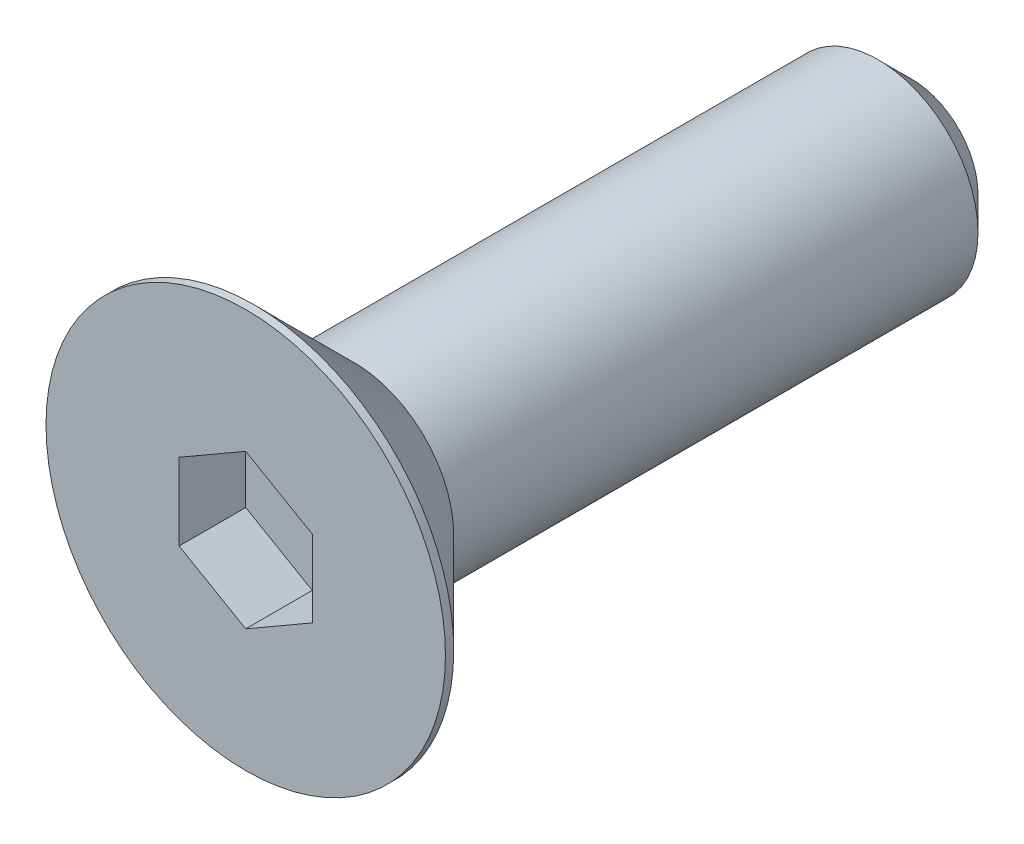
ISO-10303-21;
HEADER;
FILE_DESCRIPTION(('STEP AP214'),'2;1');
FILE_NAME('part.step','',(''),(''),'','','');
FILE_SCHEMA(('AUTOMOTIVE_DESIGN { 1 0 10303 214 1 1 1 1 }'));
ENDSEC;
DATA;
#1=APPLICATION_CONTEXT('core data for automotive mechanical design processes');
#2=APPLICATION_PROTOCOL_DEFINITION('international standard','automotive_design',2000,#1);
#3=PRODUCT_CONTEXT('',#1,'mechanical');
#4=PRODUCT('Part','Part','',(#3));
#5=PRODUCT_RELATED_PRODUCT_CATEGORY('part','',(#4));
#6=PRODUCT_DEFINITION_FORMATION('','',#4);
#7=PRODUCT_DEFINITION_CONTEXT('part definition',#1,'design');
#8=PRODUCT_DEFINITION('design','',#6,#7);
#9=PRODUCT_DEFINITION_SHAPE('','',#8);
#10=(LENGTH_UNIT() NAMED_UNIT(*) SI_UNIT(.MILLI.,.METRE.));
#11=(NAMED_UNIT(*) PLANE_ANGLE_UNIT() SI_UNIT($,.RADIAN.));
#12=(NAMED_UNIT(*) SI_UNIT($,.STERADIAN.) SOLID_ANGLE_UNIT());
#13=UNCERTAINTY_MEASURE_WITH_UNIT(LENGTH_MEASURE(1.E-05),#10,'distance_accuracy_value','');
#14=(GEOMETRIC_REPRESENTATION_CONTEXT(3) GLOBAL_UNCERTAINTY_ASSIGNED_CONTEXT((#13)) GLOBAL_UNIT_ASSIGNED_CONTEXT((#10,
#11,#12)) REPRESENTATION_CONTEXT('',''));
#15=CARTESIAN_POINT('',(0.,0.,0.));
#16=DIRECTION('',(0.,0.,1.));
#17=DIRECTION('',(1.,0.,0.));
#18=AXIS2_PLACEMENT_3D('',#15,#16,#17);
#19=CARTESIAN_POINT('',(0.,-3.9999999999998,-40.));
#20=DIRECTION('',(0.,0.,1.));
#21=DIRECTION('',(1.,0.,0.));
#22=AXIS2_PLACEMENT_3D('',#19,#20,#21);
#23=PLANE('',#22);
#24=CARTESIAN_POINT('',(0.,0.,-40.));
#25=DIRECTION('',(0.,0.,1.));
#26=DIRECTION('',(1.,0.,0.));
#27=AXIS2_PLACEMENT_3D('',#24,#25,#26);
#28=CIRCLE('',#27,3.9999999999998);
#29=CARTESIAN_POINT('',(3.9999999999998,0.,-40.));
#30=VERTEX_POINT('',#29);
#31=EDGE_CURVE('E9',#30,#30,#28,.T.);
#32=ORIENTED_EDGE('',*,*,#31,.F.);
#33=EDGE_LOOP('',(#32));
#34=FACE_BOUND('',#33,.T.);
#35=ADVANCED_FACE('F14',(#34),#23,.F.);
#36=CARTESIAN_POINT('',(0.,0.,-40.));
#37=DIRECTION('',(0.,0.,1.));
#38=DIRECTION('',(1.,0.,0.));
#39=AXIS2_PLACEMENT_3D('',#36,#37,#38);
#40=CONICAL_SURFACE('',#39,3.9999999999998,0.785398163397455);
#41=CARTESIAN_POINT('',(0.,0.,-38.));
#42=DIRECTION('',(0.,0.,1.));
#43=DIRECTION('',(1.,0.,0.));
#44=AXIS2_PLACEMENT_3D('',#41,#42,#43);
#45=CIRCLE('',#44,5.99999999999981);
#46=CARTESIAN_POINT('',(5.99999999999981,0.,-38.));
#47=VERTEX_POINT('',#46);
#48=EDGE_CURVE('E21',#47,#47,#45,.T.);
#49=ORIENTED_EDGE('',*,*,#48,.F.);
#50=EDGE_LOOP('',(#49));
#51=FACE_BOUND('',#50,.T.);
#52=ORIENTED_EDGE('',*,*,#31,.T.);
#53=EDGE_LOOP('',(#52));
#54=FACE_BOUND('',#53,.T.);
#55=ADVANCED_FACE('F135',(#51,#54),#40,.T.);
#56=CARTESIAN_POINT('',(0.,0.,-6.50000000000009));
#57=DIRECTION('',(0.,0.,1.));
#58=DIRECTION('',(1.,0.,0.));
#59=AXIS2_PLACEMENT_3D('',#56,#57,#58);
#60=CYLINDRICAL_SURFACE('',#59,6.);
#61=CARTESIAN_POINT('',(0.,0.,-6.50000000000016));
#62=DIRECTION('',(0.,0.,1.));
#63=DIRECTION('',(1.,0.,0.));
#64=AXIS2_PLACEMENT_3D('',#61,#62,#63);
#65=CIRCLE('',#64,6.00000000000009);
#66=CARTESIAN_POINT('',(6.00000000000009,0.,-6.50000000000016));
#67=VERTEX_POINT('',#66);
#68=EDGE_CURVE('E128',#67,#67,#65,.T.);
#69=ORIENTED_EDGE('',*,*,#68,.F.);
#70=EDGE_LOOP('',(#69));
#71=FACE_BOUND('',#70,.T.);
#72=ORIENTED_EDGE('',*,*,#48,.T.);
#73=EDGE_LOOP('',(#72));
#74=FACE_BOUND('',#73,.T.);
#75=ADVANCED_FACE('F133',(#71,#74),#60,.T.);
#76=CARTESIAN_POINT('',(0.,0.,-6.50000000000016));
#77=DIRECTION('',(0.,0.,1.));
#78=DIRECTION('',(1.,0.,0.));
#79=AXIS2_PLACEMENT_3D('',#76,#77,#78);
#80=CONICAL_SURFACE('',#79,6.00000000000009,0.785398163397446);
#81=CARTESIAN_POINT('',(0.,0.,-0.50000000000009));
#82=DIRECTION('',(0.,0.,1.));
#83=DIRECTION('',(1.,0.,0.));
#84=AXIS2_PLACEMENT_3D('',#81,#82,#83);
#85=CIRCLE('',#84,12.0000000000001);
#86=CARTESIAN_POINT('',(12.0000000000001,0.,-0.50000000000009));
#87=VERTEX_POINT('',#86);
#88=EDGE_CURVE('E125',#87,#87,#85,.T.);
#89=ORIENTED_EDGE('',*,*,#88,.F.);
#90=EDGE_LOOP('',(#89));
#91=FACE_BOUND('',#90,.T.);
#92=ORIENTED_EDGE('',*,*,#68,.T.);
#93=EDGE_LOOP('',(#92));
#94=FACE_BOUND('',#93,.T.);
#95=ADVANCED_FACE('F160',(#91,#94),#80,.T.);
#96=CARTESIAN_POINT('',(0.,0.,-6.50000000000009));
#97=DIRECTION('',(0.,0.,1.));
#98=DIRECTION('',(1.,0.,0.));
#99=AXIS2_PLACEMENT_3D('',#96,#97,#98);
#100=CYLINDRICAL_SURFACE('',#99,12.0000000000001);
#101=CARTESIAN_POINT('',(0.,0.,0.));
#102=DIRECTION('',(0.,0.,1.));
#103=DIRECTION('',(1.,0.,0.));
#104=AXIS2_PLACEMENT_3D('',#101,#102,#103);
#105=CIRCLE('',#104,12.0000000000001);
#106=CARTESIAN_POINT('',(12.0000000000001,0.,0.));
#107=VERTEX_POINT('',#106);
#108=EDGE_CURVE('E116',#107,#107,#105,.T.);
#109=ORIENTED_EDGE('',*,*,#108,.F.);
#110=EDGE_LOOP('',(#109));
#111=FACE_BOUND('',#110,.T.);
#112=ORIENTED_EDGE('',*,*,#88,.T.);
#113=EDGE_LOOP('',(#112));
#114=FACE_BOUND('',#113,.T.);
#115=ADVANCED_FACE('F169',(#111,#114),#100,.T.);
#116=CARTESIAN_POINT('',(0.,-1.42533798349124E-13,0.));
#117=DIRECTION('',(0.,0.,-1.));
#118=DIRECTION('',(-1.,0.,0.));
#119=AXIS2_PLACEMENT_3D('',#116,#117,#118);
#120=PLANE('',#119);
#121=DIRECTION('',(-0.866025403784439,-0.5,0.));
#122=VECTOR('',#121,1.);
#123=CARTESIAN_POINT('',(0.,4.61880215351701,0.));
#124=LINE('',#123,#122);
#125=CARTESIAN_POINT('',(0.,4.61880215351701,0.));
#126=VERTEX_POINT('',#125);
#127=CARTESIAN_POINT('',(-4.,2.30940107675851,0.));
#128=VERTEX_POINT('',#127);
#129=EDGE_CURVE('E82',#126,#128,#124,.T.);
#130=ORIENTED_EDGE('',*,*,#129,.F.);
#131=DIRECTION('',(-0.866025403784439,0.5,0.));
#132=VECTOR('',#131,1.);
#133=CARTESIAN_POINT('',(4.,2.30940107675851,0.));
#134=LINE('',#133,#132);
#135=CARTESIAN_POINT('',(4.,2.30940107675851,0.));
#136=VERTEX_POINT('',#135);
#137=EDGE_CURVE('E28',#136,#126,#134,.T.);
#138=ORIENTED_EDGE('',*,*,#137,.F.);
#139=DIRECTION('',(0.,1.,0.));
#140=VECTOR('',#139,1.);
#141=CARTESIAN_POINT('',(4.,-2.3094010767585,0.));
#142=LINE('',#141,#140);
#143=CARTESIAN_POINT('',(4.,-2.3094010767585,0.));
#144=VERTEX_POINT('',#143);
#145=EDGE_CURVE('E98',#144,#136,#142,.T.);
#146=ORIENTED_EDGE('',*,*,#145,.F.);
#147=DIRECTION('',(0.866025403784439,0.5,0.));
#148=VECTOR('',#147,1.);
#149=CARTESIAN_POINT('',(0.,-4.618802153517,0.));
#150=LINE('',#149,#148);
#151=CARTESIAN_POINT('',(0.,-4.618802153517,0.));
#152=VERTEX_POINT('',#151);
#153=EDGE_CURVE('E92',#152,#144,#150,.T.);
#154=ORIENTED_EDGE('',*,*,#153,.F.);
#155=DIRECTION('',(0.866025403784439,-0.5,0.));
#156=VECTOR('',#155,1.);
#157=CARTESIAN_POINT('',(-4.,-2.3094010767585,0.));
#158=LINE('',#157,#156);
#159=CARTESIAN_POINT('',(-4.,-2.3094010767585,0.));
#160=VERTEX_POINT('',#159);
#161=EDGE_CURVE('E90',#160,#152,#158,.T.);
#162=ORIENTED_EDGE('',*,*,#161,.F.);
#163=DIRECTION('',(0.,-1.,0.));
#164=VECTOR('',#163,1.);
#165=CARTESIAN_POINT('',(-4.,2.30940107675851,0.));
#166=LINE('',#165,#164);
#167=EDGE_CURVE('E71',#128,#160,#166,.T.);
#168=ORIENTED_EDGE('',*,*,#167,.F.);
#169=EDGE_LOOP('',(#130,#138,#146,#154,#162,#168));
#170=FACE_BOUND('',#169,.T.);
#171=ORIENTED_EDGE('',*,*,#108,.T.);
#172=EDGE_LOOP('',(#171));
#173=FACE_BOUND('',#172,.T.);
#174=ADVANCED_FACE('F86',(#170,#173),#120,.F.);
#175=CARTESIAN_POINT('',(4.,2.30940107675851,-4.));
#176=DIRECTION('',(0.5,0.866025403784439,0.));
#177=DIRECTION('',(-0.866025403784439,0.5,0.));
#178=AXIS2_PLACEMENT_3D('',#175,#176,#177);
#179=PLANE('',#178);
#180=ORIENTED_EDGE('',*,*,#137,.T.);
#181=DIRECTION('',(0.,0.,1.));
#182=VECTOR('',#181,1.);
#183=CARTESIAN_POINT('',(0.,4.61880215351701,-4.));
#184=LINE('',#183,#182);
#185=CARTESIAN_POINT('',(0.,4.61880215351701,-4.));
#186=VERTEX_POINT('',#185);
#187=EDGE_CURVE('E79',#186,#126,#184,.T.);
#188=ORIENTED_EDGE('',*,*,#187,.F.);
#189=DIRECTION('',(-0.866025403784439,0.5,0.));
#190=VECTOR('',#189,1.);
#191=CARTESIAN_POINT('',(4.,2.30940107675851,-4.));
#192=LINE('',#191,#190);
#193=CARTESIAN_POINT('',(4.,2.30940107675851,-4.));
#194=VERTEX_POINT('',#193);
#195=EDGE_CURVE('E100',#194,#186,#192,.T.);
#196=ORIENTED_EDGE('',*,*,#195,.F.);
#197=DIRECTION('',(0.,0.,1.));
#198=VECTOR('',#197,1.);
#199=CARTESIAN_POINT('',(4.,2.30940107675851,-4.));
#200=LINE('',#199,#198);
#201=EDGE_CURVE('E35',#194,#136,#200,.T.);
#202=ORIENTED_EDGE('',*,*,#201,.T.);
#203=EDGE_LOOP('',(#180,#188,#196,#202));
#204=FACE_BOUND('',#203,.T.);
#205=ADVANCED_FACE('F186',(#204),#179,.F.);
#206=CARTESIAN_POINT('',(4.,-2.3094010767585,-4.));
#207=DIRECTION('',(1.,0.,0.));
#208=DIRECTION('',(0.,1.,0.));
#209=AXIS2_PLACEMENT_3D('',#206,#207,#208);
#210=PLANE('',#209);
#211=ORIENTED_EDGE('',*,*,#145,.T.);
#212=ORIENTED_EDGE('',*,*,#201,.F.);
#213=DIRECTION('',(0.,1.,0.));
#214=VECTOR('',#213,1.);
#215=CARTESIAN_POINT('',(4.,-2.3094010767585,-4.));
#216=LINE('',#215,#214);
#217=CARTESIAN_POINT('',(4.,-2.3094010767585,-4.));
#218=VERTEX_POINT('',#217);
#219=EDGE_CURVE('E112',#218,#194,#216,.T.);
#220=ORIENTED_EDGE('',*,*,#219,.F.);
#221=DIRECTION('',(0.,0.,1.));
#222=VECTOR('',#221,1.);
#223=CARTESIAN_POINT('',(4.,-2.3094010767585,-4.));
#224=LINE('',#223,#222);
#225=EDGE_CURVE('E117',#218,#144,#224,.T.);
#226=ORIENTED_EDGE('',*,*,#225,.T.);
#227=EDGE_LOOP('',(#211,#212,#220,#226));
#228=FACE_BOUND('',#227,.T.);
#229=ADVANCED_FACE('F194',(#228),#210,.F.);
#230=CARTESIAN_POINT('',(0.,-4.618802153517,-4.));
#231=DIRECTION('',(0.5,-0.866025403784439,0.));
#232=DIRECTION('',(0.866025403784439,0.5,0.));
#233=AXIS2_PLACEMENT_3D('',#230,#231,#232);
#234=PLANE('',#233);
#235=ORIENTED_EDGE('',*,*,#153,.T.);
#236=ORIENTED_EDGE('',*,*,#225,.F.);
#237=DIRECTION('',(0.866025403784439,0.5,0.));
#238=VECTOR('',#237,1.);
#239=CARTESIAN_POINT('',(0.,-4.618802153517,-4.));
#240=LINE('',#239,#238);
#241=CARTESIAN_POINT('',(0.,-4.618802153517,-4.));
#242=VERTEX_POINT('',#241);
#243=EDGE_CURVE('E109',#242,#218,#240,.T.);
#244=ORIENTED_EDGE('',*,*,#243,.F.);
#245=DIRECTION('',(0.,0.,1.));
#246=VECTOR('',#245,1.);
#247=CARTESIAN_POINT('',(0.,-4.618802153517,-4.));
#248=LINE('',#247,#246);
#249=EDGE_CURVE('E119',#242,#152,#248,.T.);
#250=ORIENTED_EDGE('',*,*,#249,.T.);
#251=EDGE_LOOP('',(#235,#236,#244,#250));
#252=FACE_BOUND('',#251,.T.);
#253=ADVANCED_FACE('F202',(#252),#234,.F.);
#254=CARTESIAN_POINT('',(-4.,-2.3094010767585,-4.));
#255=DIRECTION('',(-0.5,-0.866025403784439,0.));
#256=DIRECTION('',(0.866025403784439,-0.5,0.));
#257=AXIS2_PLACEMENT_3D('',#254,#255,#256);
#258=PLANE('',#257);
#259=ORIENTED_EDGE('',*,*,#161,.T.);
#260=ORIENTED_EDGE('',*,*,#249,.F.);
#261=DIRECTION('',(0.866025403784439,-0.5,0.));
#262=VECTOR('',#261,1.);
#263=CARTESIAN_POINT('',(-4.,-2.3094010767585,-4.));
#264=LINE('',#263,#262);
#265=CARTESIAN_POINT('',(-4.,-2.3094010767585,-4.));
#266=VERTEX_POINT('',#265);
#267=EDGE_CURVE('E106',#266,#242,#264,.T.);
#268=ORIENTED_EDGE('',*,*,#267,.F.);
#269=DIRECTION('',(0.,0.,1.));
#270=VECTOR('',#269,1.);
#271=CARTESIAN_POINT('',(-4.,-2.3094010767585,-4.));
#272=LINE('',#271,#270);
#273=EDGE_CURVE('E78',#266,#160,#272,.T.);
#274=ORIENTED_EDGE('',*,*,#273,.T.);
#275=EDGE_LOOP('',(#259,#260,#268,#274));
#276=FACE_BOUND('',#275,.T.);
#277=ADVANCED_FACE('F210',(#276),#258,.F.);
#278=CARTESIAN_POINT('',(-4.,2.30940107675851,-4.));
#279=DIRECTION('',(-1.,0.,0.));
#280=DIRECTION('',(0.,-1.,0.));
#281=AXIS2_PLACEMENT_3D('',#278,#279,#280);
#282=PLANE('',#281);
#283=ORIENTED_EDGE('',*,*,#167,.T.);
#284=ORIENTED_EDGE('',*,*,#273,.F.);
#285=DIRECTION('',(0.,-1.,0.));
#286=VECTOR('',#285,1.);
#287=CARTESIAN_POINT('',(-4.,2.30940107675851,-4.));
#288=LINE('',#287,#286);
#289=CARTESIAN_POINT('',(-4.,2.30940107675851,-4.));
#290=VERTEX_POINT('',#289);
#291=EDGE_CURVE('E74',#290,#266,#288,.T.);
#292=ORIENTED_EDGE('',*,*,#291,.F.);
#293=DIRECTION('',(0.,0.,1.));
#294=VECTOR('',#293,1.);
#295=CARTESIAN_POINT('',(-4.,2.30940107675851,-4.));
#296=LINE('',#295,#294);
#297=EDGE_CURVE('E67',#290,#128,#296,.T.);
#298=ORIENTED_EDGE('',*,*,#297,.T.);
#299=EDGE_LOOP('',(#283,#284,#292,#298));
#300=FACE_BOUND('',#299,.T.);
#301=ADVANCED_FACE('F69',(#300),#282,.F.);
#302=CARTESIAN_POINT('',(0.,4.61880215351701,-4.));
#303=DIRECTION('',(-0.5,0.866025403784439,0.));
#304=DIRECTION('',(-0.866025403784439,-0.5,0.));
#305=AXIS2_PLACEMENT_3D('',#302,#303,#304);
#306=PLANE('',#305);
#307=ORIENTED_EDGE('',*,*,#129,.T.);
#308=ORIENTED_EDGE('',*,*,#297,.F.);
#309=DIRECTION('',(-0.866025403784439,-0.5,0.));
#310=VECTOR('',#309,1.);
#311=CARTESIAN_POINT('',(0.,4.61880215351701,-4.));
#312=LINE('',#311,#310);
#313=EDGE_CURVE('E103',#186,#290,#312,.T.);
#314=ORIENTED_EDGE('',*,*,#313,.F.);
#315=ORIENTED_EDGE('',*,*,#187,.T.);
#316=EDGE_LOOP('',(#307,#308,#314,#315));
#317=FACE_BOUND('',#316,.T.);
#318=ADVANCED_FACE('F83',(#317),#306,.F.);
#319=CARTESIAN_POINT('',(-4.,6.92820323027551,-4.));
#320=DIRECTION('',(0.,0.,1.));
#321=DIRECTION('',(1.,0.,0.));
#322=AXIS2_PLACEMENT_3D('',#319,#320,#321);
#323=PLANE('',#322);
#324=ORIENTED_EDGE('',*,*,#195,.T.);
#325=ORIENTED_EDGE('',*,*,#313,.T.);
#326=ORIENTED_EDGE('',*,*,#291,.T.);
#327=ORIENTED_EDGE('',*,*,#267,.T.);
#328=ORIENTED_EDGE('',*,*,#243,.T.);
#329=ORIENTED_EDGE('',*,*,#219,.T.);
#330=EDGE_LOOP('',(#324,#325,#326,#327,#328,#329));
#331=FACE_BOUND('',#330,.T.);
#332=ADVANCED_FACE('F234',(#331),#323,.T.);
#333=CLOSED_SHELL('',(#35,#55,#75,#95,#115,#174,#205,#229,#253,#277,#301,#318,#332));
#334=MANIFOLD_SOLID_BREP('B1',#333);
#335=ADVANCED_BREP_SHAPE_REPRESENTATION('',(#18,#334),#14);
#336=SHAPE_DEFINITION_REPRESENTATION(#9,#335);
ENDSEC;
END-ISO-10303-21;
